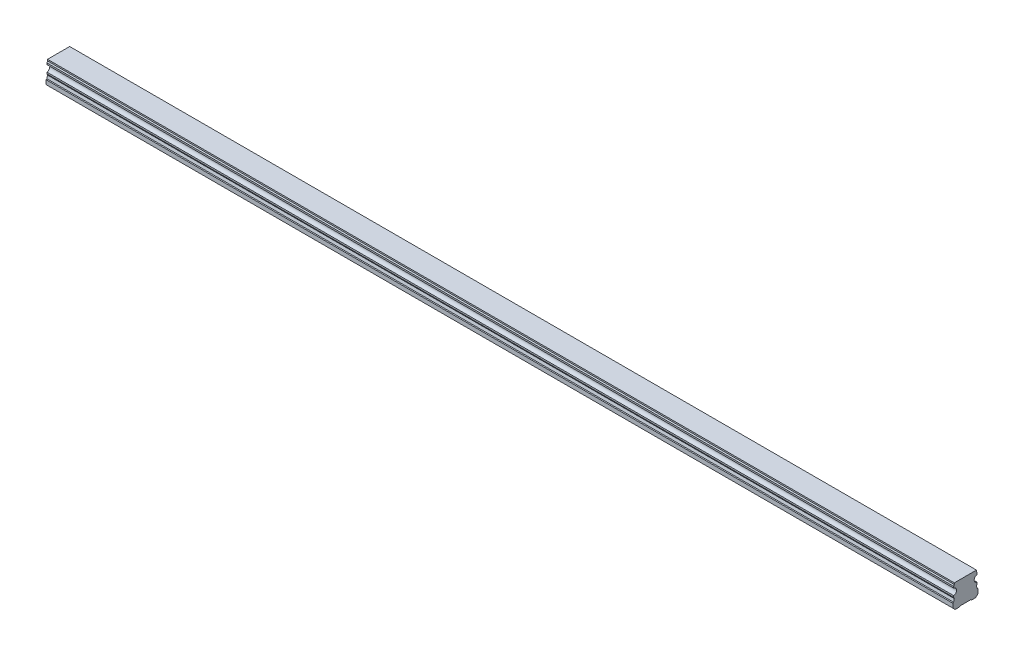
from build123d import *

# Parameters (mm, degrees)
BOSS_EXTRUDE1_DEPTH        = 540
SKETCH3_R                  = 2.5
SKETCH3_R_2                = 2.1
CUT_EXTRUDE3_DEPTH         = 7
SKETCH3_2_R                = 2.1
CUT_EXTRUDE4_DEPTH         = 9.5
CHAMFER1_SIZE              = 0.4
LPATTERN2_COUNT            = 9
LPATTERN2_PITCH            = 60
CHAMFER1_OF_LPATTERN2_SIZE = 0.4


with BuildPart() as part:
    # Sketch1 → Boss-Extrude1 (new body)
    with BuildSketch(Plane(origin=(0, 0, 0), x_dir=(0, 0, -1), z_dir=(1, 0, 0))):
        with BuildLine():
            Line((6.59, 14), (-6.59, 14))
            Line((-6.59, 14), (-6.59, 13.15))
            Line((-6.59, 13.15), (-6.96, 12.356532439))
            Line((-6.96, 12.356532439), (-6.96, 11.435174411))
            ThreePointArc((-6.96, 11.435174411), (-5.25, 9.5), (-6.96, 7.564825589))
            Line((-6.96, 7.564825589), (-6.96, 6.643467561))
            Line((-6.96, 6.643467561), (-6.59, 5.85))
            Line((-6.59, 5.85), (-7.032116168, 4.2))
            Line((-7.032116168, 4.2), (-7.5, 3.929867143))
            Line((-7.5, 3.929867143), (-7.5, 1.4))
            Line((-7.5, 1.4), (-6.1, 0))
            Line((-6.1, 0), (-3.65, 0))
            Line((-3.65, 0), (-3.25, 0.4))
            Line((-3.25, 0.4), (3.25, 0.4))
            Line((3.25, 0.4), (3.65, 0))
            Line((3.65, 0), (6.1, 0))
            Line((6.1, 0), (7.5, 1.4))
            Line((7.5, 1.4), (7.5, 3.929867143))
            Line((7.5, 3.929867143), (7.032116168, 4.2))
            Line((7.032116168, 4.2), (6.59, 5.85))
            Line((6.59, 5.85), (6.96, 6.643467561))
            Line((6.96, 6.643467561), (6.96, 7.564825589))
            ThreePointArc((6.96, 7.564825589), (5.25, 9.5), (6.96, 11.435174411))
            Line((6.96, 11.435174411), (6.96, 12.356532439))
            Line((6.96, 12.356532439), (6.59, 13.15))
            Line((6.59, 13.15), (6.59, 14))
        make_face()
    extrude(amount=BOSS_EXTRUDE1_DEPTH)

    # Sketch3 → Cut-Extrude3 (cut)
    with BuildSketch(Plane.XZ):
        with Locations(Location((30, 0, 0), (0, 0, 270))):
            Circle(SKETCH3_R)
        with Locations(Location((30, 0, 0), (0, 0, 270))):
            Circle(SKETCH3_R_2, mode=Mode.SUBTRACT)
    cut_extrude3 = extrude(amount=-CUT_EXTRUDE3_DEPTH, mode=Mode.SUBTRACT)

    # Sketch3_2 → Cut-Extrude4 (cut)
    with BuildSketch(Plane.XZ):
        with Locations(Location((30, 0, 0), (0, 0, 270))):
            Circle(SKETCH3_2_R)
    cut_extrude4 = extrude(amount=-CUT_EXTRUDE4_DEPTH, mode=Mode.SUBTRACT)

    # Cut-Extrude5 cone 1 section (on through the dimple's axis) → Cut-Extrude5 (revolve, cut)
    with BuildSketch(Plane(origin=(30, 9.5, 0), x_dir=(0, 0, -1), z_dir=(1, 0, 0))):
        Polygon((0, 0), (2.1, 0), (0, 1.212435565), align=None)
    revolve(axis=Axis((30, 9.5, 0), (0, 1, 0)), mode=Mode.SUBTRACT)

    # Chamfer1
    chamfer1_edges = [part.edges().sort_by_distance(p)[0] for p in [
        (30, 0.4, 2.5),
    ]]
    chamfer(chamfer1_edges, length=CHAMFER1_SIZE)

    # LPattern2: Cut-Extrude3, Cut-Extrude4 ×9
    with Locations(*[(i * LPATTERN2_PITCH, 0, 0) for i in range(1, LPATTERN2_COUNT)]):
        add(cut_extrude3, mode=Mode.SUBTRACT)
        add(cut_extrude4, mode=Mode.SUBTRACT)

    # Chamfer1 of LPattern2
    chamfer1_of_lpattern2_edges = [part.edges().sort_by_distance(p)[0] for p in [
        (90, 0.4, 2.5),
        (150, 0.4, 2.5),
        (210, 0.4, 2.5),
        (270, 0.4, 2.5),
        (330, 0.4, 2.5),
        (390, 0.4, 2.5),
        (450, 0.4, 2.5),
        (510, 0.4, 2.5),
    ]]
    chamfer(chamfer1_of_lpattern2_edges, length=CHAMFER1_OF_LPATTERN2_SIZE)


solid = part.part
